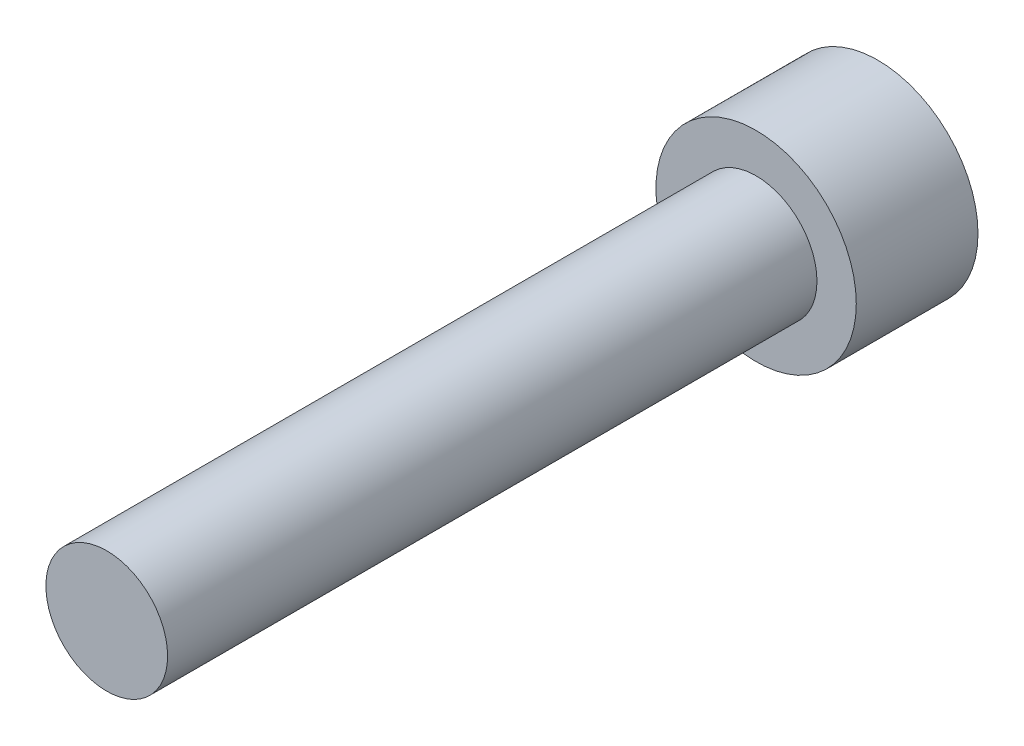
from build123d import *

# Parameters (mm, degrees)
HEX_2_DEPTH = 2.794


with BuildPart() as part:
    # Sketch6 → Revolve1 (revolve)
    with BuildSketch(Plane(origin=(0, 0, 0), x_dir=(0, 0, -1), z_dir=(1, 0, 0)), mode=Mode.PRIVATE) as revolve1_sk:
        Polygon((-22.225, 0), (-22.225, -2.0828), (0, -2.0828), (0, -3.429), (4.1656, -3.429), (4.1656, 0), align=None)
    revolve(revolve1_sk.sketch.rotate(Axis((0, 0, 22.225), (0, 0, -1)), 270), axis=Axis((0, 0, 22.225), (0, 0, -1)))

    # Sketch7 → HEX 2 (cut)
    with BuildSketch(Plane(origin=(0, 0, -4.1656), x_dir=(-1, 0, 0), z_dir=(0, 0, -1))):
        Polygon((-1.778, 1.026528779), (-1.778, -1.026528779), (0, -2.053057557), (1.778, -1.026528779), (1.778, 1.026528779), (0, 2.053057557), align=None)
    extrude(amount=-HEX_2_DEPTH, mode=Mode.SUBTRACT)


solid = part.part
